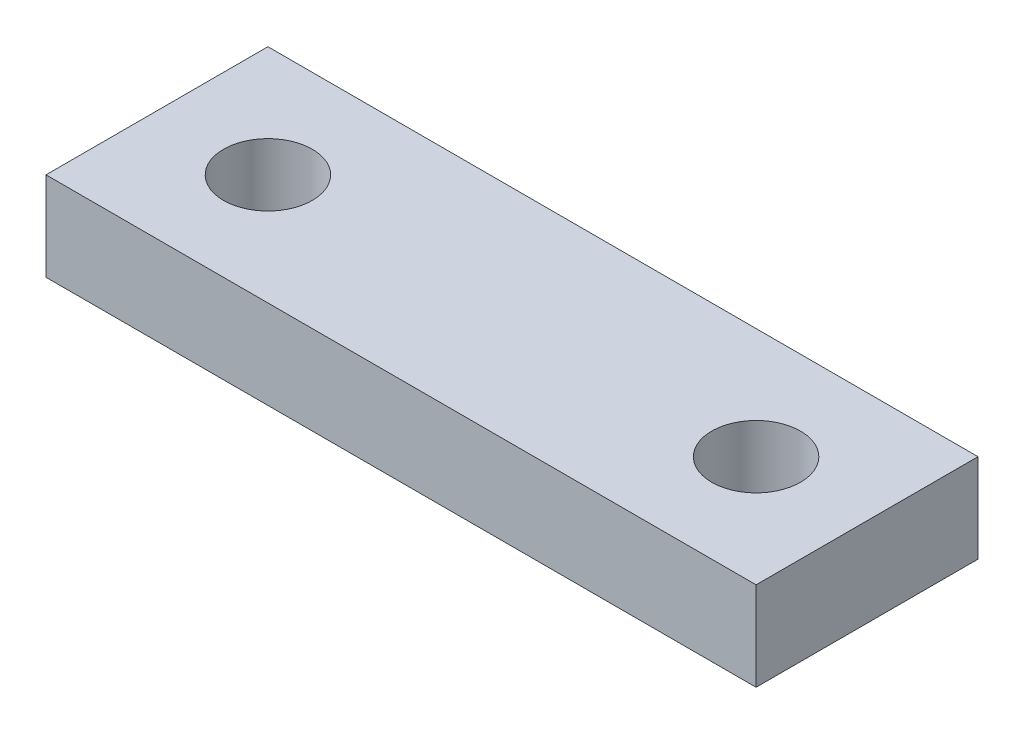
from build123d import *

# Parameters (mm, degrees)
SKETCH1_W           = 25.4
SKETCH1_H           = 7.9375
BOSS_EXTRUDE1_DEPTH = 3.175
SKETCH2_R           = 1.5875
CUT_EXTRUDE1_DEPTH  = 3.175


with BuildPart() as part:
    # Sketch1 → Boss-Extrude1 (new body)
    with BuildSketch(Plane(origin=(0, 0, 0), x_dir=(1, 0, 0), z_dir=(0, 1, 0))):
        with Locations((12.7, 3.96875)):
            Rectangle(SKETCH1_W, SKETCH1_H)
    extrude(amount=BOSS_EXTRUDE1_DEPTH)

    # Sketch2 → Cut-Extrude1 (cut)
    with BuildSketch(Plane(origin=(0, 3.175, 0), x_dir=(1, 0, 0), z_dir=(0, 1, 0))):
        with Locations(Location((21.43125, 3.96875, 0), (0, 0, 270))):
            Circle(SKETCH2_R)
        with Locations(Location((3.96875, 3.96875, 0), (0, 0, 270))):
            Circle(SKETCH2_R)
    extrude(amount=-CUT_EXTRUDE1_DEPTH, mode=Mode.SUBTRACT)


solid = part.part
